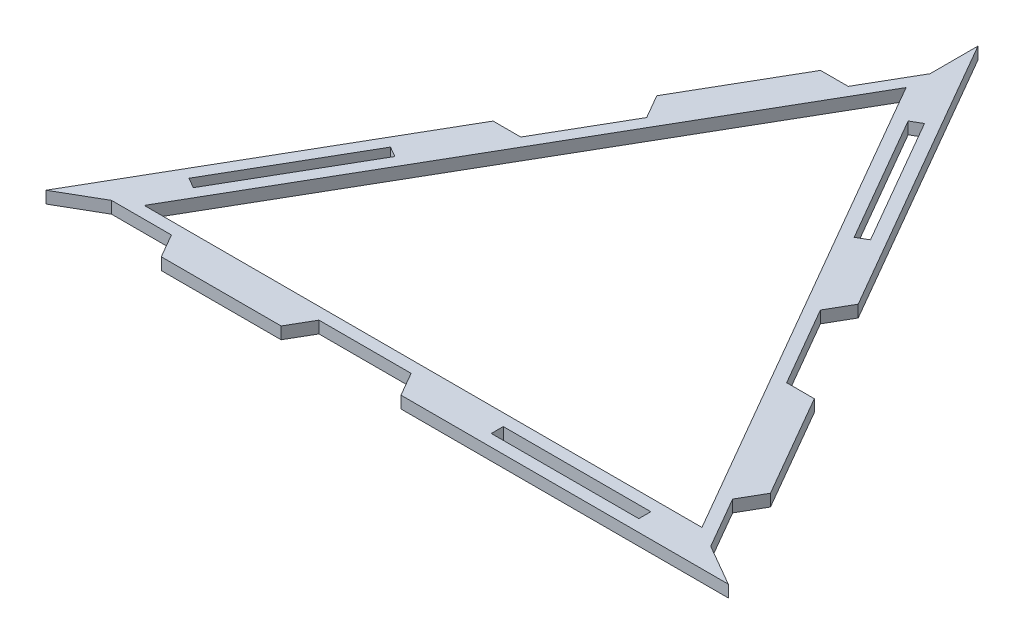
from build123d import *

# Parameters (mm, degrees)
CROQUIS1_W              = 123.094010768
CROQUIS1_H              = 10
SALIENTE_EXTRUIR1_DEPTH = 10


with BuildPart() as part:
    # Croquis1 → Saliente-Extruir1 (new body)
    with BuildSketch(Plane(origin=(0, 0, 0), x_dir=(1, 0, 0), z_dir=(0, 1, 0))):
        Polygon((0, 328.675134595), (136.547005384, 92.168783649), (125, 72.168783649), (163.452994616, 5.56624327), (186.547005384, 5.56624327), (236.547005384, -81.036297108), (225, -101.036297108), (250, -144.337567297), (284.641016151, -164.337567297), (11.547005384, -164.337567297), (0, -144.337567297), (-76.905989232, -144.337567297), (-88.452994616, -164.337567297), (-188.452994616, -164.337567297), (-200, -144.337567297), (-250, -144.337567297), (-284.641016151, -164.337567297), (-148.094010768, 72.168783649), (-125, 72.168783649), (-86.547005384, 138.771324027), (-98.094010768, 158.771324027), (-48.094010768, 245.373864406), (-25, 245.373864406), (0, 288.675134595), align=None)
        Polygon((25, 245.373864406), (86.547005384, 138.771324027), (95.207259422, 143.771324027), (33.660254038, 250.373864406), align=None, mode=Mode.SUBTRACT)
        with Locations((138.452994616, -149.337567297)):
            Rectangle(CROQUIS1_W, CROQUIS1_H, mode=Mode.SUBTRACT)
        Polygon((-225, -101.036297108), (-163.452994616, 5.56624327), (-172.113248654, 10.56624327), (-233.660254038, -96.036297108), align=None, mode=Mode.SUBTRACT)
        Polygon((0, 268.675134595), (-232.679491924, -134.337567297), (232.679491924, -134.337567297), align=None, mode=Mode.SUBTRACT)
    extrude(amount=SALIENTE_EXTRUIR1_DEPTH)


solid = part.part
